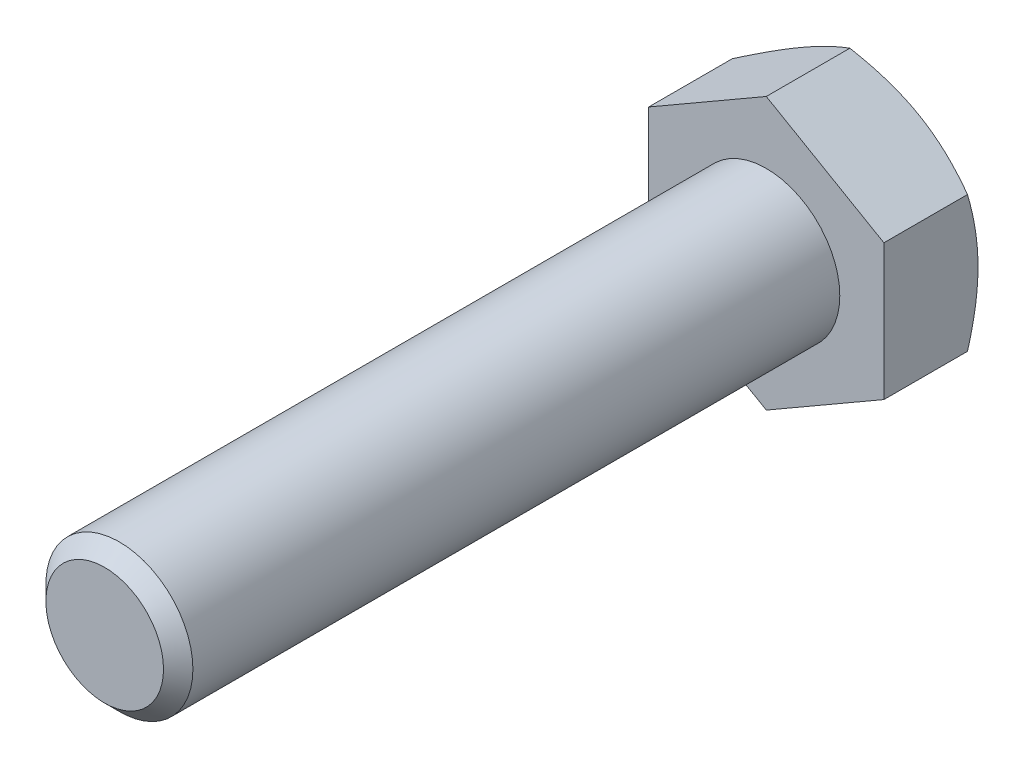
ISO-10303-21;
HEADER;
FILE_DESCRIPTION(('STEP AP214'),'2;1');
FILE_NAME('part.step','',(''),(''),'','','');
FILE_SCHEMA(('AUTOMOTIVE_DESIGN { 1 0 10303 214 1 1 1 1 }'));
ENDSEC;
DATA;
#1=APPLICATION_CONTEXT('core data for automotive mechanical design processes');
#2=APPLICATION_PROTOCOL_DEFINITION('international standard','automotive_design',2000,#1);
#3=PRODUCT_CONTEXT('',#1,'mechanical');
#4=PRODUCT('Part','Part','',(#3));
#5=PRODUCT_RELATED_PRODUCT_CATEGORY('part','',(#4));
#6=PRODUCT_DEFINITION_FORMATION('','',#4);
#7=PRODUCT_DEFINITION_CONTEXT('part definition',#1,'design');
#8=PRODUCT_DEFINITION('design','',#6,#7);
#9=PRODUCT_DEFINITION_SHAPE('','',#8);
#10=(LENGTH_UNIT() NAMED_UNIT(*) SI_UNIT(.MILLI.,.METRE.));
#11=(NAMED_UNIT(*) PLANE_ANGLE_UNIT() SI_UNIT($,.RADIAN.));
#12=(NAMED_UNIT(*) SI_UNIT($,.STERADIAN.) SOLID_ANGLE_UNIT());
#13=UNCERTAINTY_MEASURE_WITH_UNIT(LENGTH_MEASURE(1.E-05),#10,'distance_accuracy_value','');
#14=(GEOMETRIC_REPRESENTATION_CONTEXT(3) GLOBAL_UNCERTAINTY_ASSIGNED_CONTEXT((#13)) GLOBAL_UNIT_ASSIGNED_CONTEXT((#10,
#11,#12)) REPRESENTATION_CONTEXT('',''));
#15=CARTESIAN_POINT('',(0.,0.,0.));
#16=DIRECTION('',(0.,0.,1.));
#17=DIRECTION('',(1.,0.,0.));
#18=AXIS2_PLACEMENT_3D('',#15,#16,#17);
#19=CARTESIAN_POINT('',(0.,0.,45.));
#20=DIRECTION('',(0.,0.,1.));
#21=DIRECTION('',(1.,0.,0.));
#22=AXIS2_PLACEMENT_3D('',#19,#20,#21);
#23=PLANE('',#22);
#24=CARTESIAN_POINT('',(0.,0.,45.));
#25=DIRECTION('',(0.,0.,1.));
#26=DIRECTION('',(1.,0.,0.));
#27=AXIS2_PLACEMENT_3D('',#24,#25,#26);
#28=CIRCLE('',#27,4.);
#29=CARTESIAN_POINT('',(4.,0.,45.));
#30=VERTEX_POINT('',#29);
#31=EDGE_CURVE('E205',#30,#30,#28,.T.);
#32=ORIENTED_EDGE('',*,*,#31,.T.);
#33=EDGE_LOOP('',(#32));
#34=FACE_BOUND('',#33,.T.);
#35=ADVANCED_FACE('F31',(#34),#23,.T.);
#36=CARTESIAN_POINT('',(0.,0.,0.));
#37=DIRECTION('',(0.,0.,1.));
#38=DIRECTION('',(1.,0.,0.));
#39=AXIS2_PLACEMENT_3D('',#36,#37,#38);
#40=CYLINDRICAL_SURFACE('',#39,5.);
#41=CARTESIAN_POINT('',(0.,0.,44.));
#42=DIRECTION('',(0.,0.,1.));
#43=DIRECTION('',(1.,0.,0.));
#44=AXIS2_PLACEMENT_3D('',#41,#42,#43);
#45=CIRCLE('',#44,5.);
#46=CARTESIAN_POINT('',(5.00000000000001,0.,44.));
#47=VERTEX_POINT('',#46);
#48=EDGE_CURVE('E207',#47,#47,#45,.F.);
#49=ORIENTED_EDGE('',*,*,#48,.T.);
#50=EDGE_LOOP('',(#49));
#51=FACE_BOUND('',#50,.T.);
#52=CARTESIAN_POINT('',(0.,0.,0.));
#53=DIRECTION('',(0.,0.,1.));
#54=DIRECTION('',(1.,0.,0.));
#55=AXIS2_PLACEMENT_3D('',#52,#53,#54);
#56=CIRCLE('',#55,5.);
#57=CARTESIAN_POINT('',(5.,0.,0.));
#58=VERTEX_POINT('',#57);
#59=EDGE_CURVE('E208',#58,#58,#56,.F.);
#60=ORIENTED_EDGE('',*,*,#59,.F.);
#61=EDGE_LOOP('',(#60));
#62=FACE_BOUND('',#61,.T.);
#63=ADVANCED_FACE('F196',(#51,#62),#40,.T.);
#64=CARTESIAN_POINT('',(0.,0.,45.));
#65=DIRECTION('',(0.,0.,-1.));
#66=DIRECTION('',(-1.,0.,0.));
#67=AXIS2_PLACEMENT_3D('',#64,#65,#66);
#68=CONICAL_SURFACE('',#67,4.,0.785398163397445);
#69=ORIENTED_EDGE('',*,*,#48,.F.);
#70=EDGE_LOOP('',(#69));
#71=FACE_BOUND('',#70,.T.);
#72=ORIENTED_EDGE('',*,*,#31,.F.);
#73=EDGE_LOOP('',(#72));
#74=FACE_BOUND('',#73,.T.);
#75=ADVANCED_FACE('F201',(#71,#74),#68,.T.);
#76=CARTESIAN_POINT('',(0.,9.23760430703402,-6.4));
#77=DIRECTION('',(0.499999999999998,0.86602540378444,0.));
#78=DIRECTION('',(-0.86602540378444,0.499999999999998,0.));
#79=AXIS2_PLACEMENT_3D('',#76,#77,#78);
#80=PLANE('',#79);
#81=CARTESIAN_POINT('',(-0.000200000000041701,9.23771977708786,-5.68540215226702));
#82=CARTESIAN_POINT('',(0.175648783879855,9.13619343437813,-5.74400928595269));
#83=CARTESIAN_POINT('',(0.352153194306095,9.03428856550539,-5.7999565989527));
#84=CARTESIAN_POINT('',(0.70659546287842,8.82965122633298,-5.90579899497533));
#85=CARTESIAN_POINT('',(0.884533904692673,8.72691841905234,-5.95569146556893));
#86=CARTESIAN_POINT('',(1.42119823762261,8.41707512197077,-6.09530720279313));
#87=CARTESIAN_POINT('',(1.78204258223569,8.20874154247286,-6.17471882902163));
#88=CARTESIAN_POINT('',(2.32203917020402,7.89697436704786,-6.26783835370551));
#89=CARTESIAN_POINT('',(2.49957818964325,7.79447216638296,-6.29436541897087));
#90=CARTESIAN_POINT('',(2.85545911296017,7.58900421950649,-6.33884682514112));
#91=CARTESIAN_POINT('',(3.03380094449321,7.48603851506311,-6.35680192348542));
#92=CARTESIAN_POINT('',(3.39079168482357,7.27992981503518,-6.38368435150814));
#93=CARTESIAN_POINT('',(3.56944001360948,7.17678715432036,-6.39262192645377));
#94=CARTESIAN_POINT('',(3.92690170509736,6.97040655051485,-6.40127769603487));
#95=CARTESIAN_POINT('',(4.10571506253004,6.86716861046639,-6.40099617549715));
#96=CARTESIAN_POINT('',(4.44001336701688,6.67416139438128,-6.39185497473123));
#97=CARTESIAN_POINT('',(4.59552190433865,6.58437849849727,-6.38411039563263));
#98=CARTESIAN_POINT('',(4.90617476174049,6.40502298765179,-6.36179886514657));
#99=CARTESIAN_POINT('',(5.06131905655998,6.31545038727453,-6.34723145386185));
#100=CARTESIAN_POINT('',(5.5261513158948,6.04707935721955,-6.29363930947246));
#101=CARTESIAN_POINT('',(5.83501648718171,5.86875596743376,-6.24473135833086));
#102=CARTESIAN_POINT('',(6.45602322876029,5.51021755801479,-6.12246059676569));
#103=CARTESIAN_POINT('',(6.76808554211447,5.33004829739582,-6.048579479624));
#104=CARTESIAN_POINT('',(7.38755648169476,4.972396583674,-5.88089985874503));
#105=CARTESIAN_POINT('',(7.69497304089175,4.79490955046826,-5.78714073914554));
#106=CARTESIAN_POINT('',(8.0002,4.61868668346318,-5.68540215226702));
#107=B_SPLINE_CURVE_WITH_KNOTS('',3,(#81,#82,#83,#84,#85,#86,#87,#88,#89,#90,#91,#92,#93,#94,
#95,#96,#97,#98,#99,#100,#101,#102,#103,#104,#105,#106),.UNSPECIFIED.,.F.,.F.,(4,2,2,2,2,2,2,2,
2,2,2,2,4),(0.,0.633973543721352,1.26821965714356,2.53934712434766,3.1593434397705,
3.77928496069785,4.39852133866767,5.01773858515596,5.5568023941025,6.0959025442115,
7.17487077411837,8.27776850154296,9.37850115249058),.UNSPECIFIED.);
#108=CARTESIAN_POINT('',(0.,9.23760430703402,-5.68546882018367));
#109=VERTEX_POINT('',#108);
#110=CARTESIAN_POINT('',(3.99999999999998,6.92820323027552,-6.4));
#111=VERTEX_POINT('',#110);
#112=EDGE_CURVE('E241',#109,#111,#107,.T.);
#113=ORIENTED_EDGE('',*,*,#112,.F.);
#114=DIRECTION('',(0.,0.,1.));
#115=VECTOR('',#114,1.);
#116=CARTESIAN_POINT('',(0.,9.23760430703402,-6.4));
#117=LINE('',#116,#115);
#118=CARTESIAN_POINT('',(0.,9.23760430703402,0.));
#119=VERTEX_POINT('',#118);
#120=EDGE_CURVE('E215',#109,#119,#117,.T.);
#121=ORIENTED_EDGE('',*,*,#120,.T.);
#122=DIRECTION('',(-0.86602540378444,0.499999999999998,0.));
#123=VECTOR('',#122,1.);
#124=CARTESIAN_POINT('',(0.,9.23760430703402,0.));
#125=LINE('',#124,#123);
#126=CARTESIAN_POINT('',(8.,4.61880215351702,0.));
#127=VERTEX_POINT('',#126);
#128=EDGE_CURVE('E239',#127,#119,#125,.T.);
#129=ORIENTED_EDGE('',*,*,#128,.F.);
#130=DIRECTION('',(0.,0.,1.));
#131=VECTOR('',#130,1.);
#132=CARTESIAN_POINT('',(8.,4.61880215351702,-6.4));
#133=LINE('',#132,#131);
#134=CARTESIAN_POINT('',(8.,4.61880215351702,-5.68546882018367));
#135=VERTEX_POINT('',#134);
#136=EDGE_CURVE('E212',#135,#127,#133,.T.);
#137=ORIENTED_EDGE('',*,*,#136,.F.);
#138=EDGE_CURVE('E171',#111,#135,#107,.T.);
#139=ORIENTED_EDGE('',*,*,#138,.F.);
#140=EDGE_LOOP('',(#113,#121,#129,#137,#139));
#141=FACE_BOUND('',#140,.T.);
#142=ADVANCED_FACE('F181',(#141),#80,.T.);
#143=CARTESIAN_POINT('',(8.,-4.61880215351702,-6.4));
#144=DIRECTION('',(1.,0.,0.));
#145=DIRECTION('',(0.,0.,-1.));
#146=AXIS2_PLACEMENT_3D('',#143,#144,#145);
#147=PLANE('',#146);
#148=CARTESIAN_POINT('',(8.,-12.5978512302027,-2.40281206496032));
#149=CARTESIAN_POINT('',(8.,-12.246746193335,-2.57388946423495));
#150=CARTESIAN_POINT('',(8.,-11.8948553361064,-2.74338074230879));
#151=CARTESIAN_POINT('',(8.,-11.1890846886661,-3.07830251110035));
#152=CARTESIAN_POINT('',(8.,-10.835204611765,-3.24373239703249));
#153=CARTESIAN_POINT('',(8.,-10.1233054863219,-3.57043443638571));
#154=CARTESIAN_POINT('',(8.,-9.76527449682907,-3.73168065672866));
#155=CARTESIAN_POINT('',(8.,-9.04643054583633,-4.04782365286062));
#156=CARTESIAN_POINT('',(8.,-8.68561771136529,-4.20272071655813));
#157=CARTESIAN_POINT('',(8.,-7.94836823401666,-4.50960168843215));
#158=CARTESIAN_POINT('',(8.,-7.57181608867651,-4.66130959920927));
#159=CARTESIAN_POINT('',(8.,-6.81437869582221,-4.95369969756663));
#160=CARTESIAN_POINT('',(8.,-6.43349297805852,-5.09438067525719));
#161=CARTESIAN_POINT('',(8.,-5.66743059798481,-5.36116349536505));
#162=CARTESIAN_POINT('',(8.,-5.28226375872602,-5.48729325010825));
#163=CARTESIAN_POINT('',(8.,-4.50642197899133,-5.72105487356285));
#164=CARTESIAN_POINT('',(8.,-4.11574875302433,-5.82869236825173));
#165=CARTESIAN_POINT('',(8.,-3.33076858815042,-6.01985550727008));
#166=CARTESIAN_POINT('',(8.,-2.9364953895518,-6.10351603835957));
#167=CARTESIAN_POINT('',(8.,-2.34134760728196,-6.20749259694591));
#168=CARTESIAN_POINT('',(8.,-2.14232908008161,-6.23856705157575));
#169=CARTESIAN_POINT('',(8.,-1.7432391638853,-6.29294025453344));
#170=CARTESIAN_POINT('',(8.,-1.54316787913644,-6.31623975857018));
#171=CARTESIAN_POINT('',(8.,-1.14493807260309,-6.35429623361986));
#172=CARTESIAN_POINT('',(8.,-0.946790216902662,-6.36916434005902));
#173=CARTESIAN_POINT('',(8.,-0.550042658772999,-6.39050002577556));
#174=CARTESIAN_POINT('',(8.,-0.351442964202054,-6.39696775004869));
#175=CARTESIAN_POINT('',(8.,0.0458536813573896,-6.40134753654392));
#176=CARTESIAN_POINT('',(8.,0.244550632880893,-6.39925955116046));
#177=CARTESIAN_POINT('',(8.,0.641675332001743,-6.38658102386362));
#178=CARTESIAN_POINT('',(8.,0.840103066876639,-6.37599009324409));
#179=CARTESIAN_POINT('',(8.,1.31123186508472,-6.3409781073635));
#180=CARTESIAN_POINT('',(8.,1.58366327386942,-6.31284309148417));
#181=CARTESIAN_POINT('',(8.,2.12661564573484,-6.24203710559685));
#182=CARTESIAN_POINT('',(8.,2.39713636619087,-6.19936432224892));
#183=CARTESIAN_POINT('',(8.,3.20545284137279,-6.0517930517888));
#184=CARTESIAN_POINT('',(8.,3.73973646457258,-5.92736416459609));
#185=CARTESIAN_POINT('',(8.,4.53906436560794,-5.71012995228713));
#186=CARTESIAN_POINT('',(8.,4.80821183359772,-5.63154182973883));
#187=CARTESIAN_POINT('',(8.,5.34389592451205,-5.46584170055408));
#188=CARTESIAN_POINT('',(8.,5.61043252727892,-5.37872962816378));
#189=CARTESIAN_POINT('',(8.,6.14097486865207,-5.1974091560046));
#190=CARTESIAN_POINT('',(8.,6.40498129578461,-5.10320275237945));
#191=CARTESIAN_POINT('',(8.,6.93077992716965,-4.90883812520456));
#192=CARTESIAN_POINT('',(8.,7.19257218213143,-4.8086800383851));
#193=CARTESIAN_POINT('',(8.,7.89757234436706,-4.53123135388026));
#194=CARTESIAN_POINT('',(8.,8.33892089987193,-4.34922056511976));
#195=CARTESIAN_POINT('',(8.,9.21706508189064,-3.97449001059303));
#196=CARTESIAN_POINT('',(8.,9.6538601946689,-3.78176905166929));
#197=CARTESIAN_POINT('',(8.,10.5239434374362,-3.38815487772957));
#198=CARTESIAN_POINT('',(8.,10.9572301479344,-3.18725853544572));
#199=CARTESIAN_POINT('',(8.,11.8208356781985,-2.77925077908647));
#200=CARTESIAN_POINT('',(8.,12.251154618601,-2.57213961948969));
#201=CARTESIAN_POINT('',(8.,13.1101061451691,-2.15271844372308));
#202=CARTESIAN_POINT('',(8.,13.5387348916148,-1.94040058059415));
#203=CARTESIAN_POINT('',(8.,14.3940561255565,-1.51189757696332));
#204=CARTESIAN_POINT('',(8.,14.8207485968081,-1.29571240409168));
#205=CARTESIAN_POINT('',(8.,15.672448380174,-0.860283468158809));
#206=CARTESIAN_POINT('',(8.,16.0974560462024,-0.641040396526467));
#207=CARTESIAN_POINT('',(8.,16.9461557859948,-0.200021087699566));
#208=CARTESIAN_POINT('',(8.,17.3698478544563,0.0217551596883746));
#209=CARTESIAN_POINT('',(8.,18.5495919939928,0.642968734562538));
#210=CARTESIAN_POINT('',(8.,19.3044430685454,1.04468640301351));
#211=CARTESIAN_POINT('',(8.,20.8116128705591,1.85294502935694));
#212=CARTESIAN_POINT('',(8.,21.5639314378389,2.25948628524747));
#213=CARTESIAN_POINT('',(8.,23.0640825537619,3.074790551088));
#214=CARTESIAN_POINT('',(8.,23.8119216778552,3.48354147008));
#215=CARTESIAN_POINT('',(8.,24.9325210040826,4.09870759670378));
#216=CARTESIAN_POINT('',(8.,25.3058462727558,4.30409483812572));
#217=CARTESIAN_POINT('',(8.,26.0521604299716,4.71547851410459));
#218=CARTESIAN_POINT('',(8.,26.4251493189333,4.92147494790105));
#219=CARTESIAN_POINT('',(8.,26.7979906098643,5.12773824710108));
#220=B_SPLINE_CURVE_WITH_KNOTS('',3,(#148,#149,#150,#151,#152,#153,#154,#155,#156,#157,#158,
#159,#160,#161,#162,#163,#164,#165,#166,#167,#168,#169,#170,#171,#172,#173,#174,#175,#176,#177,
#178,#179,#180,#181,#182,#183,#184,#185,#186,#187,#188,#189,#190,#191,#192,#193,#194,#195,#196,
#197,#198,#199,#200,#201,#202,#203,#204,#205,#206,#207,#208,#209,#210,#211,#212,#213,#214,#215,
#216,#217,#218,#219),.UNSPECIFIED.,.F.,.F.,(4,2,2,2,2,2,2,2,2,2,2,2,2,2,2,2,2,2,2,2,2,2,2,2,2,2,
2,2,2,2,2,2,2,2,2,4),(0.,1.17171303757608,2.34359951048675,3.52154779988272,4.69944261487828,
5.91720060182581,7.13509201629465,8.35060698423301,9.56575149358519,10.7739194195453,
11.3780811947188,11.982184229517,12.5781274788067,13.1740604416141,13.7699967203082,
14.3659602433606,15.1871414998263,16.0084252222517,17.651791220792,18.4928743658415,
19.3339639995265,20.1748178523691,21.0156523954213,22.4476587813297,23.8798250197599,
25.312544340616,26.7452050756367,28.1801767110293,29.6151603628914,31.0498246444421,
32.48449470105,35.0497345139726,37.6151336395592,40.1718943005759,41.4501744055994,
42.7284529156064),.UNSPECIFIED.);
#221=CARTESIAN_POINT('',(8.,0.,-6.4));
#222=VERTEX_POINT('',#221);
#223=EDGE_CURVE('E169',#135,#222,#220,.F.);
#224=ORIENTED_EDGE('',*,*,#223,.F.);
#225=ORIENTED_EDGE('',*,*,#136,.T.);
#226=DIRECTION('',(0.,1.,0.));
#227=VECTOR('',#226,1.);
#228=CARTESIAN_POINT('',(8.,-4.61880215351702,0.));
#229=LINE('',#228,#227);
#230=CARTESIAN_POINT('',(8.,-4.61880215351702,0.));
#231=VERTEX_POINT('',#230);
#232=EDGE_CURVE('E217',#231,#127,#229,.T.);
#233=ORIENTED_EDGE('',*,*,#232,.F.);
#234=DIRECTION('',(0.,0.,1.));
#235=VECTOR('',#234,1.);
#236=CARTESIAN_POINT('',(8.,-4.61880215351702,-6.4));
#237=LINE('',#236,#235);
#238=CARTESIAN_POINT('',(8.,-4.61880215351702,-5.68546882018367));
#239=VERTEX_POINT('',#238);
#240=EDGE_CURVE('E223',#239,#231,#237,.T.);
#241=ORIENTED_EDGE('',*,*,#240,.F.);
#242=EDGE_CURVE('E164',#222,#239,#220,.F.);
#243=ORIENTED_EDGE('',*,*,#242,.F.);
#244=EDGE_LOOP('',(#224,#225,#233,#241,#243));
#245=FACE_BOUND('',#244,.T.);
#246=ADVANCED_FACE('F177',(#245),#147,.T.);
#247=CARTESIAN_POINT('',(0.,-9.23760430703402,-6.4));
#248=DIRECTION('',(0.499999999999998,-0.86602540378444,0.));
#249=DIRECTION('',(0.86602540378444,0.499999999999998,0.));
#250=AXIS2_PLACEMENT_3D('',#247,#248,#249);
#251=PLANE('',#250);
#252=CARTESIAN_POINT('',(8.0002,-4.61868668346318,-5.68540215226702));
#253=CARTESIAN_POINT('',(7.8243512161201,-4.72021302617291,-5.74400928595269));
#254=CARTESIAN_POINT('',(7.64784680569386,-4.82211789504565,-5.7999565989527));
#255=CARTESIAN_POINT('',(7.29340453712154,-5.02675523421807,-5.90579899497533));
#256=CARTESIAN_POINT('',(7.11546609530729,-5.12948804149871,-5.95569146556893));
#257=CARTESIAN_POINT('',(6.57880176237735,-5.43933133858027,-6.09530720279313));
#258=CARTESIAN_POINT('',(6.21795741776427,-5.64766491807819,-6.17471882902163));
#259=CARTESIAN_POINT('',(5.67796082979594,-5.95943209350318,-6.26783835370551));
#260=CARTESIAN_POINT('',(5.50042181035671,-6.06193429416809,-6.29436541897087));
#261=CARTESIAN_POINT('',(5.14454088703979,-6.26740224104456,-6.33884682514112));
#262=CARTESIAN_POINT('',(4.96619905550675,-6.37036794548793,-6.35680192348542));
#263=CARTESIAN_POINT('',(4.60920831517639,-6.57647664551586,-6.38368435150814));
#264=CARTESIAN_POINT('',(4.43055998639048,-6.67961930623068,-6.39262192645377));
#265=CARTESIAN_POINT('',(4.0730982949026,-6.88599991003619,-6.40127769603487));
#266=CARTESIAN_POINT('',(3.89428493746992,-6.98923785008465,-6.40099617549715));
#267=CARTESIAN_POINT('',(3.55998663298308,-7.18224506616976,-6.39185497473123));
#268=CARTESIAN_POINT('',(3.40447809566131,-7.27202796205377,-6.38411039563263));
#269=CARTESIAN_POINT('',(3.09382523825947,-7.45138347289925,-6.36179886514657));
#270=CARTESIAN_POINT('',(2.93868094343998,-7.54095607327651,-6.34723145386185));
#271=CARTESIAN_POINT('',(2.47384868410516,-7.80932710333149,-6.29363930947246));
#272=CARTESIAN_POINT('',(2.16498351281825,-7.98765049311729,-6.24473135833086));
#273=CARTESIAN_POINT('',(1.54397677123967,-8.34618890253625,-6.12246059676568));
#274=CARTESIAN_POINT('',(1.23191445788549,-8.52635816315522,-6.048579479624));
#275=CARTESIAN_POINT('',(0.612443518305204,-8.88400987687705,-5.88089985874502));
#276=CARTESIAN_POINT('',(0.30502695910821,-9.06149691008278,-5.78714073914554));
#277=CARTESIAN_POINT('',(-0.000200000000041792,-9.23771977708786,-5.68540215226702));
#278=B_SPLINE_CURVE_WITH_KNOTS('',3,(#252,#253,#254,#255,#256,#257,#258,#259,#260,#261,#262,
#263,#264,#265,#266,#267,#268,#269,#270,#271,#272,#273,#274,#275,#276,#277),.UNSPECIFIED.,.F.,
.F.,(4,2,2,2,2,2,2,2,2,2,2,2,4),(0.,0.633973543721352,1.26821965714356,2.53934712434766,
3.1593434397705,3.77928496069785,4.39852133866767,5.01773858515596,5.5568023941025,
6.09590254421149,7.17487077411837,8.27776850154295,9.37850115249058),.UNSPECIFIED.);
#279=CARTESIAN_POINT('',(3.99999999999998,-6.92820323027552,-6.4));
#280=VERTEX_POINT('',#279);
#281=EDGE_CURVE('E170',#239,#280,#278,.T.);
#282=ORIENTED_EDGE('',*,*,#281,.F.);
#283=ORIENTED_EDGE('',*,*,#240,.T.);
#284=DIRECTION('',(0.86602540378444,0.499999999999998,0.));
#285=VECTOR('',#284,1.);
#286=CARTESIAN_POINT('',(0.,-9.23760430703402,0.));
#287=LINE('',#286,#285);
#288=CARTESIAN_POINT('',(0.,-9.23760430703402,0.));
#289=VERTEX_POINT('',#288);
#290=EDGE_CURVE('E228',#289,#231,#287,.T.);
#291=ORIENTED_EDGE('',*,*,#290,.F.);
#292=DIRECTION('',(0.,0.,1.));
#293=VECTOR('',#292,1.);
#294=CARTESIAN_POINT('',(0.,-9.23760430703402,-6.4));
#295=LINE('',#294,#293);
#296=CARTESIAN_POINT('',(0.,-9.23760430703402,-5.68546882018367));
#297=VERTEX_POINT('',#296);
#298=EDGE_CURVE('E221',#297,#289,#295,.T.);
#299=ORIENTED_EDGE('',*,*,#298,.F.);
#300=EDGE_CURVE('E158',#280,#297,#278,.T.);
#301=ORIENTED_EDGE('',*,*,#300,.F.);
#302=EDGE_LOOP('',(#282,#283,#291,#299,#301));
#303=FACE_BOUND('',#302,.T.);
#304=ADVANCED_FACE('F180',(#303),#251,.T.);
#305=CARTESIAN_POINT('',(0.,-9.23760430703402,-6.4));
#306=DIRECTION('',(-0.500000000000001,-0.866025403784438,0.));
#307=DIRECTION('',(0.866025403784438,-0.500000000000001,0.));
#308=AXIS2_PLACEMENT_3D('',#305,#306,#307);
#309=PLANE('',#308);
#310=CARTESIAN_POINT('',(0.000199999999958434,-9.23771977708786,-5.68540215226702));
#311=CARTESIAN_POINT('',(-0.175648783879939,-9.13619343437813,-5.74400928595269));
#312=CARTESIAN_POINT('',(-0.352153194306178,-9.03428856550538,-5.7999565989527));
#313=CARTESIAN_POINT('',(-0.706595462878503,-8.82965122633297,-5.90579899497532));
#314=CARTESIAN_POINT('',(-0.884533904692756,-8.72691841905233,-5.95569146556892));
#315=CARTESIAN_POINT('',(-1.42119823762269,-8.41707512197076,-6.09530720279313));
#316=CARTESIAN_POINT('',(-1.78204258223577,-8.20874154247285,-6.17471882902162));
#317=CARTESIAN_POINT('',(-2.3220391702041,-7.89697436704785,-6.2678383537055));
#318=CARTESIAN_POINT('',(-2.49957818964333,-7.79447216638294,-6.29436541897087));
#319=CARTESIAN_POINT('',(-2.85545911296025,-7.58900421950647,-6.33884682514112));
#320=CARTESIAN_POINT('',(-3.03380094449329,-7.4860385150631,-6.35680192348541));
#321=CARTESIAN_POINT('',(-3.39079168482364,-7.27992981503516,-6.38368435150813));
#322=CARTESIAN_POINT('',(-3.56944001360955,-7.17678715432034,-6.39262192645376));
#323=CARTESIAN_POINT('',(-3.92690170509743,-6.97040655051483,-6.40127769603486));
#324=CARTESIAN_POINT('',(-4.10571506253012,-6.86716861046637,-6.40099617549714));
#325=CARTESIAN_POINT('',(-4.44001336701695,-6.67416139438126,-6.39185497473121));
#326=CARTESIAN_POINT('',(-4.59552190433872,-6.58437849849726,-6.38411039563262));
#327=CARTESIAN_POINT('',(-4.90617476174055,-6.40502298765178,-6.36179886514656));
#328=CARTESIAN_POINT('',(-5.06131905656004,-6.31545038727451,-6.34723145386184));
#329=CARTESIAN_POINT('',(-5.52615131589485,-6.04707935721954,-6.29363930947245));
#330=CARTESIAN_POINT('',(-5.83501648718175,-5.86875596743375,-6.24473135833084));
#331=CARTESIAN_POINT('',(-6.45602322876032,-5.51021755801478,-6.12246059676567));
#332=CARTESIAN_POINT('',(-6.76808554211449,-5.33004829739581,-6.04857947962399));
#333=CARTESIAN_POINT('',(-7.38755648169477,-4.97239658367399,-5.88089985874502));
#334=CARTESIAN_POINT('',(-7.69497304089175,-4.79490955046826,-5.78714073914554));
#335=CARTESIAN_POINT('',(-8.0002,-4.61868668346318,-5.68540215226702));
#336=B_SPLINE_CURVE_WITH_KNOTS('',3,(#310,#311,#312,#313,#314,#315,#316,#317,#318,#319,#320,
#321,#322,#323,#324,#325,#326,#327,#328,#329,#330,#331,#332,#333,#334,#335),.UNSPECIFIED.,.F.,
.F.,(4,2,2,2,2,2,2,2,2,2,2,2,4),(0.,0.633973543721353,1.26821965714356,2.53934712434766,
3.1593434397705,3.77928496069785,4.39852133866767,5.01773858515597,5.55680239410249,
6.09590254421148,7.17487077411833,8.2777685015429,9.37850115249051),.UNSPECIFIED.);
#337=CARTESIAN_POINT('',(-4.00000000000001,-6.9282032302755,-6.4));
#338=VERTEX_POINT('',#337);
#339=EDGE_CURVE('E260',#297,#338,#336,.T.);
#340=ORIENTED_EDGE('',*,*,#339,.F.);
#341=ORIENTED_EDGE('',*,*,#298,.T.);
#342=DIRECTION('',(0.866025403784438,-0.500000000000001,0.));
#343=VECTOR('',#342,1.);
#344=CARTESIAN_POINT('',(0.,-9.23760430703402,0.));
#345=LINE('',#344,#343);
#346=CARTESIAN_POINT('',(-8.,-4.61880215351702,0.));
#347=VERTEX_POINT('',#346);
#348=EDGE_CURVE('E231',#347,#289,#345,.T.);
#349=ORIENTED_EDGE('',*,*,#348,.F.);
#350=DIRECTION('',(0.,0.,1.));
#351=VECTOR('',#350,1.);
#352=CARTESIAN_POINT('',(-8.,-4.61880215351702,-6.4));
#353=LINE('',#352,#351);
#354=CARTESIAN_POINT('',(-8.,-4.61880215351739,-5.68546882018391));
#355=VERTEX_POINT('',#354);
#356=EDGE_CURVE('E219',#355,#347,#353,.T.);
#357=ORIENTED_EDGE('',*,*,#356,.F.);
#358=EDGE_CURVE('E107',#338,#355,#336,.T.);
#359=ORIENTED_EDGE('',*,*,#358,.F.);
#360=EDGE_LOOP('',(#340,#341,#349,#357,#359));
#361=FACE_BOUND('',#360,.T.);
#362=ADVANCED_FACE('F185',(#361),#309,.T.);
#363=CARTESIAN_POINT('',(-8.,-4.61880215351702,-6.4));
#364=DIRECTION('',(-1.,0.,0.));
#365=DIRECTION('',(0.,0.,1.));
#366=AXIS2_PLACEMENT_3D('',#363,#364,#365);
#367=PLANE('',#366);
#368=CARTESIAN_POINT('',(-8.,-12.5978512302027,-2.40281206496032));
#369=CARTESIAN_POINT('',(-8.,-12.246746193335,-2.57388946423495));
#370=CARTESIAN_POINT('',(-8.,-11.8948553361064,-2.74338074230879));
#371=CARTESIAN_POINT('',(-8.,-11.1890846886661,-3.07830251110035));
#372=CARTESIAN_POINT('',(-8.,-10.835204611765,-3.24373239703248));
#373=CARTESIAN_POINT('',(-8.,-10.1233054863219,-3.57043443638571));
#374=CARTESIAN_POINT('',(-8.,-9.76527449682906,-3.73168065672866));
#375=CARTESIAN_POINT('',(-8.,-9.04643054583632,-4.04782365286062));
#376=CARTESIAN_POINT('',(-8.,-8.68561771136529,-4.20272071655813));
#377=CARTESIAN_POINT('',(-8.,-7.94836823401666,-4.50960168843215));
#378=CARTESIAN_POINT('',(-8.,-7.57181608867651,-4.66130959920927));
#379=CARTESIAN_POINT('',(-8.,-6.8143786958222,-4.95369969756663));
#380=CARTESIAN_POINT('',(-8.,-6.43349297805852,-5.09438067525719));
#381=CARTESIAN_POINT('',(-8.,-5.66743059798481,-5.36116349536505));
#382=CARTESIAN_POINT('',(-8.,-5.28226375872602,-5.48729325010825));
#383=CARTESIAN_POINT('',(-8.,-4.50642197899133,-5.72105487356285));
#384=CARTESIAN_POINT('',(-8.,-4.11574875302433,-5.82869236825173));
#385=CARTESIAN_POINT('',(-8.,-3.33076858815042,-6.01985550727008));
#386=CARTESIAN_POINT('',(-8.,-2.9364953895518,-6.10351603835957));
#387=CARTESIAN_POINT('',(-8.,-2.34134760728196,-6.20749259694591));
#388=CARTESIAN_POINT('',(-8.,-2.1423290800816,-6.23856705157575));
#389=CARTESIAN_POINT('',(-8.,-1.74323916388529,-6.29294025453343));
#390=CARTESIAN_POINT('',(-8.,-1.54316787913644,-6.31623975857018));
#391=CARTESIAN_POINT('',(-8.,-1.14493807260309,-6.35429623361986));
#392=CARTESIAN_POINT('',(-8.,-0.94679021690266,-6.36916434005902));
#393=CARTESIAN_POINT('',(-8.,-0.550042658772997,-6.39050002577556));
#394=CARTESIAN_POINT('',(-8.,-0.351442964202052,-6.39696775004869));
#395=CARTESIAN_POINT('',(-8.,0.0458536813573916,-6.40134753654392));
#396=CARTESIAN_POINT('',(-8.,0.244550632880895,-6.39925955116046));
#397=CARTESIAN_POINT('',(-8.,0.641675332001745,-6.38658102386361));
#398=CARTESIAN_POINT('',(-8.,0.84010306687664,-6.37599009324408));
#399=CARTESIAN_POINT('',(-8.,1.31123186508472,-6.3409781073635));
#400=CARTESIAN_POINT('',(-8.,1.58366327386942,-6.31284309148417));
#401=CARTESIAN_POINT('',(-8.,2.12661564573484,-6.24203710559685));
#402=CARTESIAN_POINT('',(-8.,2.39713636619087,-6.19936432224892));
#403=CARTESIAN_POINT('',(-8.,3.20545284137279,-6.0517930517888));
#404=CARTESIAN_POINT('',(-8.,3.73973646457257,-5.92736416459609));
#405=CARTESIAN_POINT('',(-8.,4.53906436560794,-5.71012995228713));
#406=CARTESIAN_POINT('',(-8.,4.80821183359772,-5.63154182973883));
#407=CARTESIAN_POINT('',(-8.,5.34389592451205,-5.46584170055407));
#408=CARTESIAN_POINT('',(-8.,5.61043252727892,-5.37872962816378));
#409=CARTESIAN_POINT('',(-8.,6.14097486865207,-5.1974091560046));
#410=CARTESIAN_POINT('',(-8.,6.40498129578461,-5.10320275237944));
#411=CARTESIAN_POINT('',(-8.,6.93077992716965,-4.90883812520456));
#412=CARTESIAN_POINT('',(-8.,7.19257218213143,-4.8086800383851));
#413=CARTESIAN_POINT('',(-8.,7.89757234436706,-4.53123135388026));
#414=CARTESIAN_POINT('',(-8.,8.33892089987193,-4.34922056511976));
#415=CARTESIAN_POINT('',(-8.,9.21706508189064,-3.97449001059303));
#416=CARTESIAN_POINT('',(-8.,9.6538601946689,-3.78176905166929));
#417=CARTESIAN_POINT('',(-8.,10.5239434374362,-3.38815487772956));
#418=CARTESIAN_POINT('',(-8.,10.9572301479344,-3.18725853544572));
#419=CARTESIAN_POINT('',(-8.,11.8208356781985,-2.77925077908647));
#420=CARTESIAN_POINT('',(-8.,12.251154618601,-2.57213961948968));
#421=CARTESIAN_POINT('',(-8.,13.1101061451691,-2.15271844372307));
#422=CARTESIAN_POINT('',(-8.,13.5387348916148,-1.94040058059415));
#423=CARTESIAN_POINT('',(-8.,14.3940561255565,-1.51189757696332));
#424=CARTESIAN_POINT('',(-8.,14.8207485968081,-1.29571240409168));
#425=CARTESIAN_POINT('',(-8.,15.672448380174,-0.860283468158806));
#426=CARTESIAN_POINT('',(-8.,16.0974560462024,-0.641040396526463));
#427=CARTESIAN_POINT('',(-8.,16.9461557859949,-0.200021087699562));
#428=CARTESIAN_POINT('',(-8.,17.3698478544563,0.0217551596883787));
#429=CARTESIAN_POINT('',(-8.,18.5495919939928,0.642968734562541));
#430=CARTESIAN_POINT('',(-8.,19.3044430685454,1.04468640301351));
#431=CARTESIAN_POINT('',(-8.,20.8116128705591,1.85294502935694));
#432=CARTESIAN_POINT('',(-8.,21.5639314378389,2.25948628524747));
#433=CARTESIAN_POINT('',(-8.,23.0640825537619,3.07479055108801));
#434=CARTESIAN_POINT('',(-8.,23.8119216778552,3.48354147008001));
#435=CARTESIAN_POINT('',(-8.,24.9325210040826,4.09870759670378));
#436=CARTESIAN_POINT('',(-8.,25.3058462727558,4.30409483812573));
#437=CARTESIAN_POINT('',(-8.,26.0521604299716,4.7154785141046));
#438=CARTESIAN_POINT('',(-8.,26.4251493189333,4.92147494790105));
#439=CARTESIAN_POINT('',(-8.,26.7979906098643,5.12773824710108));
#440=B_SPLINE_CURVE_WITH_KNOTS('',3,(#368,#369,#370,#371,#372,#373,#374,#375,#376,#377,#378,
#379,#380,#381,#382,#383,#384,#385,#386,#387,#388,#389,#390,#391,#392,#393,#394,#395,#396,#397,
#398,#399,#400,#401,#402,#403,#404,#405,#406,#407,#408,#409,#410,#411,#412,#413,#414,#415,#416,
#417,#418,#419,#420,#421,#422,#423,#424,#425,#426,#427,#428,#429,#430,#431,#432,#433,#434,#435,
#436,#437,#438,#439),.UNSPECIFIED.,.F.,.F.,(4,2,2,2,2,2,2,2,2,2,2,2,2,2,2,2,2,2,2,2,2,2,2,2,2,2,
2,2,2,2,2,2,2,2,2,4),(0.,1.17171303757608,2.34359951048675,3.52154779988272,4.69944261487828,
5.91720060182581,7.13509201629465,8.35060698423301,9.56575149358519,10.7739194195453,
11.3780811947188,11.982184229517,12.5781274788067,13.1740604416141,13.7699967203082,
14.3659602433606,15.1871414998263,16.0084252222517,17.651791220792,18.4928743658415,
19.3339639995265,20.1748178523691,21.0156523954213,22.4476587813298,23.8798250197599,
25.312544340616,26.7452050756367,28.1801767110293,29.6151603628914,31.0498246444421,
32.48449470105,35.0497345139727,37.6151336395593,40.1718943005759,41.4501744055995,
42.7284529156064),.UNSPECIFIED.);
#441=CARTESIAN_POINT('',(-8.,0.,-6.4));
#442=VERTEX_POINT('',#441);
#443=EDGE_CURVE('E102',#355,#442,#440,.T.);
#444=ORIENTED_EDGE('',*,*,#443,.F.);
#445=ORIENTED_EDGE('',*,*,#356,.T.);
#446=DIRECTION('',(0.,-1.,0.));
#447=VECTOR('',#446,1.);
#448=CARTESIAN_POINT('',(-8.,-4.61880215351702,0.));
#449=LINE('',#448,#447);
#450=CARTESIAN_POINT('',(-8.,4.61880215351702,0.));
#451=VERTEX_POINT('',#450);
#452=EDGE_CURVE('E234',#451,#347,#449,.T.);
#453=ORIENTED_EDGE('',*,*,#452,.F.);
#454=DIRECTION('',(0.,0.,1.));
#455=VECTOR('',#454,1.);
#456=CARTESIAN_POINT('',(-8.,4.61880215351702,-6.4));
#457=LINE('',#456,#455);
#458=CARTESIAN_POINT('',(-8.,4.61880215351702,-5.68546882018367));
#459=VERTEX_POINT('',#458);
#460=EDGE_CURVE('E128',#459,#451,#457,.T.);
#461=ORIENTED_EDGE('',*,*,#460,.F.);
#462=EDGE_CURVE('E111',#442,#459,#440,.T.);
#463=ORIENTED_EDGE('',*,*,#462,.F.);
#464=EDGE_LOOP('',(#444,#445,#453,#461,#463));
#465=FACE_BOUND('',#464,.T.);
#466=ADVANCED_FACE('F126',(#465),#367,.T.);
#467=CARTESIAN_POINT('',(-8.,4.61880215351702,-6.4));
#468=DIRECTION('',(-0.500000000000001,0.866025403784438,0.));
#469=DIRECTION('',(-0.866025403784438,-0.500000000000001,0.));
#470=AXIS2_PLACEMENT_3D('',#467,#468,#469);
#471=PLANE('',#470);
#472=CARTESIAN_POINT('',(-8.0002,4.61868668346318,-5.68540215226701));
#473=CARTESIAN_POINT('',(-7.8243512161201,4.72021302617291,-5.74400928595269));
#474=CARTESIAN_POINT('',(-7.64784680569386,4.82211789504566,-5.7999565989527));
#475=CARTESIAN_POINT('',(-7.29340453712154,5.02675523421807,-5.90579899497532));
#476=CARTESIAN_POINT('',(-7.11546609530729,5.12948804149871,-5.95569146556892));
#477=CARTESIAN_POINT('',(-6.57880176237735,5.43933133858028,-6.09530720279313));
#478=CARTESIAN_POINT('',(-6.21795741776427,5.6476649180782,-6.17471882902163));
#479=CARTESIAN_POINT('',(-5.67796082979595,5.95943209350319,-6.2678383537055));
#480=CARTESIAN_POINT('',(-5.50042181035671,6.0619342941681,-6.29436541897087));
#481=CARTESIAN_POINT('',(-5.1445408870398,6.26740224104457,-6.33884682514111));
#482=CARTESIAN_POINT('',(-4.96619905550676,6.37036794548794,-6.35680192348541));
#483=CARTESIAN_POINT('',(-4.6092083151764,6.57647664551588,-6.38368435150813));
#484=CARTESIAN_POINT('',(-4.43055998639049,6.6796193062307,-6.39262192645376));
#485=CARTESIAN_POINT('',(-4.07309829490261,6.88599991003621,-6.40127769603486));
#486=CARTESIAN_POINT('',(-3.89428493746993,6.98923785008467,-6.40099617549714));
#487=CARTESIAN_POINT('',(-3.55998663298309,7.18224506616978,-6.39185497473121));
#488=CARTESIAN_POINT('',(-3.40447809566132,7.27202796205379,-6.38411039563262));
#489=CARTESIAN_POINT('',(-3.09382523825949,7.45138347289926,-6.36179886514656));
#490=CARTESIAN_POINT('',(-2.93868094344,7.54095607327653,-6.34723145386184));
#491=CARTESIAN_POINT('',(-2.47384868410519,7.80932710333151,-6.29363930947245));
#492=CARTESIAN_POINT('',(-2.16498351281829,7.9876504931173,-6.24473135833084));
#493=CARTESIAN_POINT('',(-1.54397677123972,8.34618890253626,-6.12246059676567));
#494=CARTESIAN_POINT('',(-1.23191445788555,8.52635816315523,-6.04857947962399));
#495=CARTESIAN_POINT('',(-0.612443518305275,8.88400987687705,-5.88089985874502));
#496=CARTESIAN_POINT('',(-0.305026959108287,9.06149691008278,-5.78714073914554));
#497=CARTESIAN_POINT('',(0.000199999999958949,9.23771977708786,-5.68540215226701));
#498=B_SPLINE_CURVE_WITH_KNOTS('',3,(#472,#473,#474,#475,#476,#477,#478,#479,#480,#481,#482,
#483,#484,#485,#486,#487,#488,#489,#490,#491,#492,#493,#494,#495,#496,#497),.UNSPECIFIED.,.F.,
.F.,(4,2,2,2,2,2,2,2,2,2,2,2,4),(0.,0.633973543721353,1.26821965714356,2.53934712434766,
3.1593434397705,3.77928496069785,4.39852133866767,5.01773858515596,5.55680239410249,
6.09590254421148,7.17487077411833,8.2777685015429,9.3785011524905),.UNSPECIFIED.);
#499=CARTESIAN_POINT('',(-4.00000000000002,6.92820323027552,-6.4));
#500=VERTEX_POINT('',#499);
#501=EDGE_CURVE('E117',#459,#500,#498,.T.);
#502=ORIENTED_EDGE('',*,*,#501,.F.);
#503=ORIENTED_EDGE('',*,*,#460,.T.);
#504=DIRECTION('',(-0.866025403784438,-0.500000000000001,0.));
#505=VECTOR('',#504,1.);
#506=CARTESIAN_POINT('',(-8.,4.61880215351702,0.));
#507=LINE('',#506,#505);
#508=EDGE_CURVE('E237',#119,#451,#507,.T.);
#509=ORIENTED_EDGE('',*,*,#508,.F.);
#510=ORIENTED_EDGE('',*,*,#120,.F.);
#511=EDGE_CURVE('E119',#500,#109,#498,.T.);
#512=ORIENTED_EDGE('',*,*,#511,.F.);
#513=EDGE_LOOP('',(#502,#503,#509,#510,#512));
#514=FACE_BOUND('',#513,.T.);
#515=ADVANCED_FACE('F193',(#514),#471,.T.);
#516=CARTESIAN_POINT('',(8.,4.61880215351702,0.));
#517=DIRECTION('',(0.,0.,1.));
#518=DIRECTION('',(1.,0.,0.));
#519=AXIS2_PLACEMENT_3D('',#516,#517,#518);
#520=PLANE('',#519);
#521=ORIENTED_EDGE('',*,*,#59,.T.);
#522=EDGE_LOOP('',(#521));
#523=FACE_BOUND('',#522,.T.);
#524=ORIENTED_EDGE('',*,*,#128,.T.);
#525=ORIENTED_EDGE('',*,*,#508,.T.);
#526=ORIENTED_EDGE('',*,*,#452,.T.);
#527=ORIENTED_EDGE('',*,*,#348,.T.);
#528=ORIENTED_EDGE('',*,*,#290,.T.);
#529=ORIENTED_EDGE('',*,*,#232,.T.);
#530=EDGE_LOOP('',(#524,#525,#526,#527,#528,#529));
#531=FACE_BOUND('',#530,.T.);
#532=ADVANCED_FACE('F150',(#523,#531),#520,.T.);
#533=CARTESIAN_POINT('',(0.,0.,0.));
#534=DIRECTION('',(0.,0.,1.));
#535=DIRECTION('',(1.,0.,0.));
#536=AXIS2_PLACEMENT_3D('',#533,#534,#535);
#537=CONICAL_SURFACE('',#536,19.0851251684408,1.0471975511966);
#538=ORIENTED_EDGE('',*,*,#138,.T.);
#539=ORIENTED_EDGE('',*,*,#223,.T.);
#540=CARTESIAN_POINT('',(0.,0.,-6.4));
#541=DIRECTION('',(0.,0.,1.));
#542=DIRECTION('',(1.,0.,0.));
#543=AXIS2_PLACEMENT_3D('',#540,#541,#542);
#544=CIRCLE('',#543,8.);
#545=EDGE_CURVE('E34',#111,#222,#544,.F.);
#546=ORIENTED_EDGE('',*,*,#545,.F.);
#547=EDGE_LOOP('',(#538,#539,#546));
#548=FACE_BOUND('',#547,.T.);
#549=ADVANCED_FACE('F250',(#548),#537,.T.);
#550=ORIENTED_EDGE('',*,*,#112,.T.);
#551=EDGE_CURVE('E124',#500,#111,#544,.F.);
#552=ORIENTED_EDGE('',*,*,#551,.F.);
#553=ORIENTED_EDGE('',*,*,#511,.T.);
#554=EDGE_LOOP('',(#550,#552,#553));
#555=FACE_BOUND('',#554,.T.);
#556=ADVANCED_FACE('F149',(#555),#537,.T.);
#557=ORIENTED_EDGE('',*,*,#462,.T.);
#558=ORIENTED_EDGE('',*,*,#501,.T.);
#559=CARTESIAN_POINT('',(0.,0.,-6.4));
#560=DIRECTION('',(0.,0.,-1.));
#561=DIRECTION('',(-1.,0.,0.));
#562=AXIS2_PLACEMENT_3D('',#559,#560,#561);
#563=CIRCLE('',#562,8.);
#564=EDGE_CURVE('E52',#442,#500,#563,.T.);
#565=ORIENTED_EDGE('',*,*,#564,.F.);
#566=EDGE_LOOP('',(#557,#558,#565));
#567=FACE_BOUND('',#566,.T.);
#568=ADVANCED_FACE('F115',(#567),#537,.T.);
#569=ORIENTED_EDGE('',*,*,#358,.T.);
#570=ORIENTED_EDGE('',*,*,#443,.T.);
#571=EDGE_CURVE('E104',#338,#442,#544,.F.);
#572=ORIENTED_EDGE('',*,*,#571,.F.);
#573=EDGE_LOOP('',(#569,#570,#572));
#574=FACE_BOUND('',#573,.T.);
#575=ADVANCED_FACE('F103',(#574),#537,.T.);
#576=ORIENTED_EDGE('',*,*,#300,.T.);
#577=ORIENTED_EDGE('',*,*,#339,.T.);
#578=EDGE_CURVE('E39',#280,#338,#544,.F.);
#579=ORIENTED_EDGE('',*,*,#578,.F.);
#580=EDGE_LOOP('',(#576,#577,#579));
#581=FACE_BOUND('',#580,.T.);
#582=ADVANCED_FACE('F262',(#581),#537,.T.);
#583=ORIENTED_EDGE('',*,*,#242,.T.);
#584=ORIENTED_EDGE('',*,*,#281,.T.);
#585=EDGE_CURVE('E11',#222,#280,#544,.F.);
#586=ORIENTED_EDGE('',*,*,#585,.F.);
#587=EDGE_LOOP('',(#583,#584,#586));
#588=FACE_BOUND('',#587,.T.);
#589=ADVANCED_FACE('F257',(#588),#537,.T.);
#590=CARTESIAN_POINT('',(8.,4.61880215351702,-6.4));
#591=DIRECTION('',(0.,0.,1.));
#592=DIRECTION('',(1.,0.,0.));
#593=AXIS2_PLACEMENT_3D('',#590,#591,#592);
#594=PLANE('',#593);
#595=ORIENTED_EDGE('',*,*,#545,.T.);
#596=ORIENTED_EDGE('',*,*,#585,.T.);
#597=ORIENTED_EDGE('',*,*,#578,.T.);
#598=ORIENTED_EDGE('',*,*,#571,.T.);
#599=ORIENTED_EDGE('',*,*,#564,.T.);
#600=ORIENTED_EDGE('',*,*,#551,.T.);
#601=EDGE_LOOP('',(#595,#596,#597,#598,#599,#600));
#602=FACE_BOUND('',#601,.T.);
#603=ADVANCED_FACE('F122',(#602),#594,.F.);
#604=CLOSED_SHELL('',(#35,#63,#75,#142,#246,#304,#362,#466,#515,#532,#549,#556,#568,#575,#582,
#589,#603));
#605=MANIFOLD_SOLID_BREP('B2',#604);
#606=ADVANCED_BREP_SHAPE_REPRESENTATION('',(#18,#605),#14);
#607=SHAPE_DEFINITION_REPRESENTATION(#9,#606);
ENDSEC;
END-ISO-10303-21;
